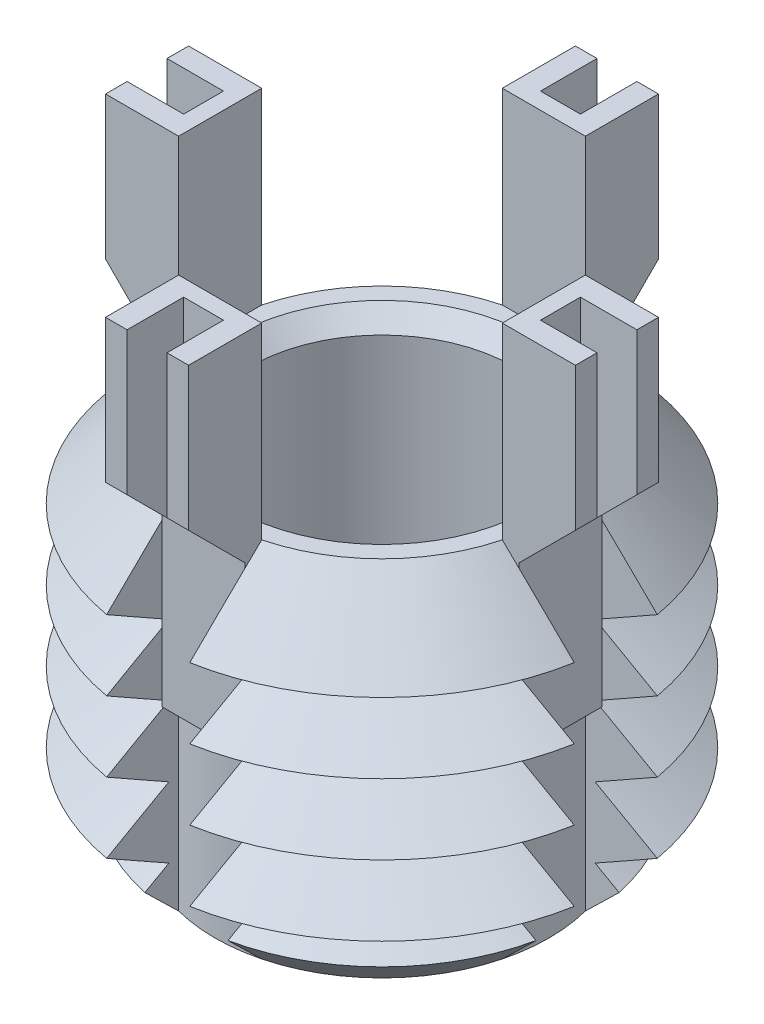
from build123d import *

# Parameters (mm, degrees)
SKETCH1_R               = 7.144
BOSS_EXTRUDE1_DEPTH     = 10.922
CHAMFER1_SIZE           = 2.117
LPATTERN1_COUNT         = 4
LPATTERN1_PITCH         = 2.117
CUT_EXTRUDE1_REACH      = 16.878
CIRPATTERN1_COUNT       = 4
BOSS_EXTRUDE3_DEPTH     = 1.25
CIRPATTERN2_COUNT       = 4
CUT_EXTRUDE3_DEPTH      = 20.353104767
CUT_EXTRUDE3_DEPTH_BACK = 20.353104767
SKETCH6_W               = 1.7
SKETCH6_H               = 1.2
SKETCH6_W_2             = 1.2
SKETCH6_H_2             = 1.7
SKETCH7_R               = 3.969
CUT_EXTRUDE4_DEPTH      = 10.922
CHAMFER2_SIZE           = 0.529


with BuildPart() as part:
    # Sketch1 → Boss-Extrude1 (new body)
    with BuildSketch(Plane(origin=(0, 0, 0), x_dir=(1, 0, 0), z_dir=(0, 1, 0))):
        with Locations(Location((0, 0, 0), (0, 0, 270))):
            Circle(SKETCH1_R)
    extrude(amount=-BOSS_EXTRUDE1_DEPTH)

    # Chamfer1
    chamfer1_edges = [part.edges().sort_by_distance(p)[0] for p in [
        (0, 0, -7.144),
        (0, -10.922, -7.144),
    ]]
    chamfer(chamfer1_edges, length=CHAMFER1_SIZE)

    # Sketch3 → Cut-Revolve1 (revolve, cut)
    with BuildSketch(Plane(origin=(0, 0, 0), x_dir=(0, 0, -1), z_dir=(1, 0, 0))):
        Polygon((-7.144, -2.117), (-5.31062422, -3.1755), (-7.144, -4.234), align=None)
    cut_revolve1 = revolve(axis=Axis((0, 0.885892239, 0), (0, -1, 0)), mode=Mode.SUBTRACT)

    # LPattern1: Cut-Revolve1 ×4
    with Locations(*[(0, -i * LPATTERN1_PITCH, 0) for i in range(1, LPATTERN1_COUNT)]):
        add(cut_revolve1, mode=Mode.SUBTRACT)

    # Cut-Extrude1: up to this cone (the profile starts inside it)
    cut_extrude1_end = Plane(origin=(0, 0, 0), z_dir=(0, 1, 0)).offset(-15.948999) * Cone(1e-06, 49.276, 49.275999, align=(Align.CENTER, Align.CENTER, Align.MIN), mode=Mode.PRIVATE)
    # Sketch4 → Cut-Extrude1 (cut, up to the surface)
    with BuildSketch(Plane(origin=(0, 0, 0), x_dir=(1, 0, 0), z_dir=(0, 1, 0)), mode=Mode.PRIVATE) as cut_extrude1_sk1:
        with BuildLine():
            Line((-4.869109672, 1.25), (-7.033792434, 1.25))
            ThreePointArc((-7.033792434, 1.25), (-7.144, 0), (-7.033792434, -1.25))
            Line((-7.033792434, -1.25), (-4.869109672, -1.25))
            ThreePointArc((-4.869109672, -1.25), (-5.027, 0), (-4.869109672, 1.25))
        make_face()
    cut_extrude1_tool1 = extrude(cut_extrude1_sk1.sketch, amount=-CUT_EXTRUDE1_REACH, mode=Mode.PRIVATE) & cut_extrude1_end
    cut_extrude1 = cut_extrude1_tool1.solids().sort_by_distance((-6.040777, 0, 0))[0]
    add(cut_extrude1, mode=Mode.SUBTRACT)

    # CirPattern1: Cut-Extrude1 ×4 about axis
    cirpattern1_axis = Axis((0, 0, 0), (0, 1, 0))
    for i in range(1, CIRPATTERN1_COUNT):
        add(cut_extrude1.rotate(cirpattern1_axis, i * 360 / CIRPATTERN1_COUNT), mode=Mode.SUBTRACT)

    # Sketch5 → Boss-Extrude3 (add, symmetric)
    with BuildSketch(Plane(origin=(0, 0, 0), x_dir=(0, 0, -1), z_dir=(1, 0, 0))):
        Polygon((-4.869109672, 5.649), (-4.869109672, -5.351), (-5.369109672, -5.351), (-5.369109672, -0.351), (-7.069109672, 1.349), (-7.069109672, 5.649), align=None)
    boss_extrude3 = extrude(amount=BOSS_EXTRUDE3_DEPTH, both=True)

    # CirPattern2: Boss-Extrude3 ×4 about axis
    cirpattern2_axis = Axis((0, 0, 0), (0, 1, 0))
    for i in range(1, CIRPATTERN2_COUNT):
        add(boss_extrude3.rotate(cirpattern2_axis, i * 360 / CIRPATTERN2_COUNT))

    # Sketch6 → Cut-Extrude3 (cut, two sides: drawn at the far end of the back side and taken through both)
    with BuildSketch(Plane(origin=(0, 5.649, 0), x_dir=(1, 0, 0), z_dir=(0, 1, 0)).offset(-CUT_EXTRUDE3_DEPTH_BACK)):
        with Locations((-6.219109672, 0)):
            Rectangle(SKETCH6_W, SKETCH6_H)
        with Locations((0, 6.219109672)):
            Rectangle(SKETCH6_W_2, SKETCH6_H_2)
        with Locations((6.219109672, 0)):
            Rectangle(SKETCH6_W, SKETCH6_H)
        with Locations((0, -6.219109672)):
            Rectangle(SKETCH6_W_2, SKETCH6_H_2)
    extrude(amount=CUT_EXTRUDE3_DEPTH + CUT_EXTRUDE3_DEPTH_BACK, mode=Mode.SUBTRACT)

    # Sketch7 → Cut-Extrude4 (cut)
    with BuildSketch(Plane(origin=(0, 0, 0), x_dir=(1, 0, 0), z_dir=(0, 1, 0))):
        with Locations(Location((0, 0, 0), (0, 0, 270))):
            Circle(SKETCH7_R)
    extrude(amount=-CUT_EXTRUDE4_DEPTH, mode=Mode.SUBTRACT)

    # Chamfer2
    chamfer2_edges = [part.edges().sort_by_distance(p)[0] for p in [
        (0, 0, -3.969),
        (0, -10.922, -3.969),
    ]]
    chamfer(chamfer2_edges, length=CHAMFER2_SIZE)


solid = part.part
